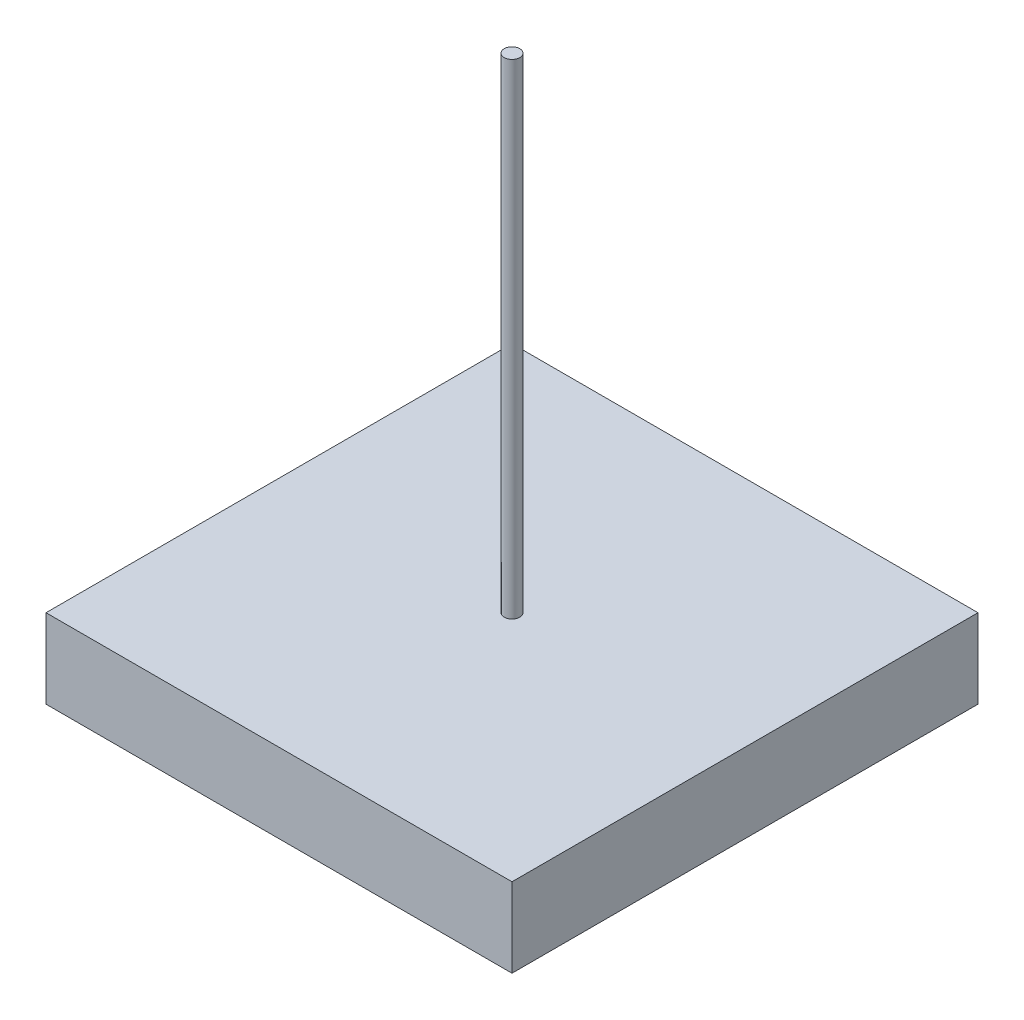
ISO-10303-21;
HEADER;
FILE_DESCRIPTION(('STEP AP214'),'2;1');
FILE_NAME('part.step','',(''),(''),'','','');
FILE_SCHEMA(('AUTOMOTIVE_DESIGN { 1 0 10303 214 1 1 1 1 }'));
ENDSEC;
DATA;
#1=APPLICATION_CONTEXT('core data for automotive mechanical design processes');
#2=APPLICATION_PROTOCOL_DEFINITION('international standard','automotive_design',2000,#1);
#3=PRODUCT_CONTEXT('',#1,'mechanical');
#4=PRODUCT('Part','Part','',(#3));
#5=PRODUCT_RELATED_PRODUCT_CATEGORY('part','',(#4));
#6=PRODUCT_DEFINITION_FORMATION('','',#4);
#7=PRODUCT_DEFINITION_CONTEXT('part definition',#1,'design');
#8=PRODUCT_DEFINITION('design','',#6,#7);
#9=PRODUCT_DEFINITION_SHAPE('','',#8);
#10=(LENGTH_UNIT() NAMED_UNIT(*) SI_UNIT(.MILLI.,.METRE.));
#11=(NAMED_UNIT(*) PLANE_ANGLE_UNIT() SI_UNIT($,.RADIAN.));
#12=(NAMED_UNIT(*) SI_UNIT($,.STERADIAN.) SOLID_ANGLE_UNIT());
#13=UNCERTAINTY_MEASURE_WITH_UNIT(LENGTH_MEASURE(1.E-05),#10,'distance_accuracy_value','');
#14=(GEOMETRIC_REPRESENTATION_CONTEXT(3) GLOBAL_UNCERTAINTY_ASSIGNED_CONTEXT((#13)) GLOBAL_UNIT_ASSIGNED_CONTEXT((#10,
#11,#12)) REPRESENTATION_CONTEXT('',''));
#15=CARTESIAN_POINT('',(0.,0.,0.));
#16=DIRECTION('',(0.,0.,1.));
#17=DIRECTION('',(1.,0.,0.));
#18=AXIS2_PLACEMENT_3D('',#15,#16,#17);
#19=CARTESIAN_POINT('',(-150.,3.,150.));
#20=DIRECTION('',(-1.,0.,0.));
#21=DIRECTION('',(0.,0.,1.));
#22=AXIS2_PLACEMENT_3D('',#19,#20,#21);
#23=PLANE('',#22);
#24=DIRECTION('',(0.,0.,-1.));
#25=VECTOR('',#24,1.);
#26=CARTESIAN_POINT('',(-150.,0.,150.));
#27=LINE('',#26,#25);
#28=CARTESIAN_POINT('',(-150.,0.,150.));
#29=VERTEX_POINT('',#28);
#30=CARTESIAN_POINT('',(-150.,0.,-150.));
#31=VERTEX_POINT('',#30);
#32=EDGE_CURVE('E107',#29,#31,#27,.T.);
#33=ORIENTED_EDGE('',*,*,#32,.F.);
#34=DIRECTION('',(0.,-1.,0.));
#35=VECTOR('',#34,1.);
#36=CARTESIAN_POINT('',(-150.,3.,150.));
#37=LINE('',#36,#35);
#38=CARTESIAN_POINT('',(-150.,51.,150.));
#39=VERTEX_POINT('',#38);
#40=EDGE_CURVE('E60',#39,#29,#37,.T.);
#41=ORIENTED_EDGE('',*,*,#40,.F.);
#42=DIRECTION('',(0.,0.,1.));
#43=VECTOR('',#42,1.);
#44=CARTESIAN_POINT('',(-150.,51.,-150.));
#45=LINE('',#44,#43);
#46=CARTESIAN_POINT('',(-150.,51.,-150.));
#47=VERTEX_POINT('',#46);
#48=EDGE_CURVE('E105',#47,#39,#45,.T.);
#49=ORIENTED_EDGE('',*,*,#48,.F.);
#50=DIRECTION('',(0.,-1.,0.));
#51=VECTOR('',#50,1.);
#52=CARTESIAN_POINT('',(-150.,3.,-150.));
#53=LINE('',#52,#51);
#54=EDGE_CURVE('E170',#47,#31,#53,.T.);
#55=ORIENTED_EDGE('',*,*,#54,.T.);
#56=EDGE_LOOP('',(#33,#41,#49,#55));
#57=FACE_BOUND('',#56,.T.);
#58=ADVANCED_FACE('F36',(#57),#23,.T.);
#59=CARTESIAN_POINT('',(-150.,3.,150.));
#60=DIRECTION('',(0.,0.,-1.));
#61=DIRECTION('',(-1.,0.,0.));
#62=AXIS2_PLACEMENT_3D('',#59,#60,#61);
#63=PLANE('',#62);
#64=DIRECTION('',(1.,0.,0.));
#65=VECTOR('',#64,1.);
#66=CARTESIAN_POINT('',(-150.,0.,150.));
#67=LINE('',#66,#65);
#68=CARTESIAN_POINT('',(150.,0.,150.));
#69=VERTEX_POINT('',#68);
#70=EDGE_CURVE('E169',#29,#69,#67,.T.);
#71=ORIENTED_EDGE('',*,*,#70,.T.);
#72=DIRECTION('',(0.,-1.,0.));
#73=VECTOR('',#72,1.);
#74=CARTESIAN_POINT('',(150.,3.,150.));
#75=LINE('',#74,#73);
#76=CARTESIAN_POINT('',(150.,51.,150.));
#77=VERTEX_POINT('',#76);
#78=EDGE_CURVE('E108',#77,#69,#75,.T.);
#79=ORIENTED_EDGE('',*,*,#78,.F.);
#80=DIRECTION('',(1.,0.,0.));
#81=VECTOR('',#80,1.);
#82=CARTESIAN_POINT('',(-150.,51.,150.));
#83=LINE('',#82,#81);
#84=EDGE_CURVE('E111',#39,#77,#83,.T.);
#85=ORIENTED_EDGE('',*,*,#84,.F.);
#86=ORIENTED_EDGE('',*,*,#40,.T.);
#87=EDGE_LOOP('',(#71,#79,#85,#86));
#88=FACE_BOUND('',#87,.T.);
#89=ADVANCED_FACE('F112',(#88),#63,.F.);
#90=CARTESIAN_POINT('',(150.,3.,150.));
#91=DIRECTION('',(-1.,0.,0.));
#92=DIRECTION('',(0.,0.,1.));
#93=AXIS2_PLACEMENT_3D('',#90,#91,#92);
#94=PLANE('',#93);
#95=DIRECTION('',(0.,0.,-1.));
#96=VECTOR('',#95,1.);
#97=CARTESIAN_POINT('',(150.,0.,150.));
#98=LINE('',#97,#96);
#99=CARTESIAN_POINT('',(150.,0.,-150.));
#100=VERTEX_POINT('',#99);
#101=EDGE_CURVE('E166',#69,#100,#98,.T.);
#102=ORIENTED_EDGE('',*,*,#101,.T.);
#103=DIRECTION('',(0.,-1.,0.));
#104=VECTOR('',#103,1.);
#105=CARTESIAN_POINT('',(150.,3.,-150.));
#106=LINE('',#105,#104);
#107=CARTESIAN_POINT('',(150.,51.,-150.));
#108=VERTEX_POINT('',#107);
#109=EDGE_CURVE('E173',#108,#100,#106,.T.);
#110=ORIENTED_EDGE('',*,*,#109,.F.);
#111=DIRECTION('',(0.,0.,-1.));
#112=VECTOR('',#111,1.);
#113=CARTESIAN_POINT('',(150.,51.,-150.));
#114=LINE('',#113,#112);
#115=EDGE_CURVE('E117',#77,#108,#114,.T.);
#116=ORIENTED_EDGE('',*,*,#115,.F.);
#117=ORIENTED_EDGE('',*,*,#78,.T.);
#118=EDGE_LOOP('',(#102,#110,#116,#117));
#119=FACE_BOUND('',#118,.T.);
#120=ADVANCED_FACE('F269',(#119),#94,.F.);
#121=CARTESIAN_POINT('',(-150.,3.,-150.));
#122=DIRECTION('',(0.,0.,-1.));
#123=DIRECTION('',(-1.,0.,0.));
#124=AXIS2_PLACEMENT_3D('',#121,#122,#123);
#125=PLANE('',#124);
#126=DIRECTION('',(1.,0.,0.));
#127=VECTOR('',#126,1.);
#128=CARTESIAN_POINT('',(-150.,0.,-150.));
#129=LINE('',#128,#127);
#130=EDGE_CURVE('E163',#31,#100,#129,.T.);
#131=ORIENTED_EDGE('',*,*,#130,.F.);
#132=ORIENTED_EDGE('',*,*,#54,.F.);
#133=DIRECTION('',(-1.,0.,0.));
#134=VECTOR('',#133,1.);
#135=CARTESIAN_POINT('',(-150.,51.,-150.));
#136=LINE('',#135,#134);
#137=EDGE_CURVE('E123',#108,#47,#136,.T.);
#138=ORIENTED_EDGE('',*,*,#137,.F.);
#139=ORIENTED_EDGE('',*,*,#109,.T.);
#140=EDGE_LOOP('',(#131,#132,#138,#139));
#141=FACE_BOUND('',#140,.T.);
#142=ADVANCED_FACE('F282',(#141),#125,.T.);
#143=CARTESIAN_POINT('',(0.,0.,0.));
#144=DIRECTION('',(0.,-1.,0.));
#145=DIRECTION('',(0.,0.,-1.));
#146=AXIS2_PLACEMENT_3D('',#143,#144,#145);
#147=PLANE('',#146);
#148=ORIENTED_EDGE('',*,*,#32,.T.);
#149=ORIENTED_EDGE('',*,*,#130,.T.);
#150=ORIENTED_EDGE('',*,*,#101,.F.);
#151=ORIENTED_EDGE('',*,*,#70,.F.);
#152=EDGE_LOOP('',(#148,#149,#150,#151));
#153=FACE_BOUND('',#152,.T.);
#154=ADVANCED_FACE('F295',(#153),#147,.T.);
#155=CARTESIAN_POINT('',(0.,51.,0.));
#156=DIRECTION('',(0.,1.,0.));
#157=DIRECTION('',(0.,0.,1.));
#158=AXIS2_PLACEMENT_3D('',#155,#156,#157);
#159=PLANE('',#158);
#160=ORIENTED_EDGE('',*,*,#48,.T.);
#161=ORIENTED_EDGE('',*,*,#84,.T.);
#162=ORIENTED_EDGE('',*,*,#115,.T.);
#163=ORIENTED_EDGE('',*,*,#137,.T.);
#164=EDGE_LOOP('',(#160,#161,#162,#163));
#165=FACE_BOUND('',#164,.T.);
#166=CARTESIAN_POINT('',(0.,51.,0.));
#167=DIRECTION('',(0.,1.,0.));
#168=DIRECTION('',(0.,0.,1.));
#169=AXIS2_PLACEMENT_3D('',#166,#167,#168);
#170=CIRCLE('',#169,5.);
#171=CARTESIAN_POINT('',(0.,51.,-5.));
#172=VERTEX_POINT('',#171);
#173=EDGE_CURVE('E39',#172,#172,#170,.T.);
#174=ORIENTED_EDGE('',*,*,#173,.F.);
#175=EDGE_LOOP('',(#174));
#176=FACE_BOUND('',#175,.T.);
#177=ADVANCED_FACE('F120',(#165,#176),#159,.T.);
#178=CARTESIAN_POINT('',(0.,363.,0.));
#179=DIRECTION('',(0.,1.,0.));
#180=DIRECTION('',(0.,0.,1.));
#181=AXIS2_PLACEMENT_3D('',#178,#179,#180);
#182=PLANE('',#181);
#183=CARTESIAN_POINT('',(0.,363.,0.));
#184=DIRECTION('',(0.,1.,0.));
#185=DIRECTION('',(0.,0.,1.));
#186=AXIS2_PLACEMENT_3D('',#183,#184,#185);
#187=CIRCLE('',#186,5.);
#188=CARTESIAN_POINT('',(0.,363.,-5.));
#189=VERTEX_POINT('',#188);
#190=EDGE_CURVE('E128',#189,#189,#187,.T.);
#191=ORIENTED_EDGE('',*,*,#190,.T.);
#192=EDGE_LOOP('',(#191));
#193=FACE_BOUND('',#192,.T.);
#194=ADVANCED_FACE('F212',(#193),#182,.T.);
#195=CARTESIAN_POINT('',(0.,363.,0.));
#196=DIRECTION('',(0.,-1.,0.));
#197=DIRECTION('',(0.,0.,-1.));
#198=AXIS2_PLACEMENT_3D('',#195,#196,#197);
#199=CYLINDRICAL_SURFACE('',#198,5.);
#200=CARTESIAN_POINT('',(0.,51.,-5.));
#201=CARTESIAN_POINT('',(0.,54.25,-5.));
#202=CARTESIAN_POINT('',(0.,57.5,-5.));
#203=CARTESIAN_POINT('',(0.,64.,-5.));
#204=CARTESIAN_POINT('',(0.,67.25,-5.));
#205=CARTESIAN_POINT('',(0.,73.75,-5.));
#206=CARTESIAN_POINT('',(0.,77.,-5.));
#207=CARTESIAN_POINT('',(0.,83.5,-5.));
#208=CARTESIAN_POINT('',(0.,86.75,-5.));
#209=CARTESIAN_POINT('',(0.,93.25,-5.));
#210=CARTESIAN_POINT('',(0.,96.5,-5.));
#211=CARTESIAN_POINT('',(0.,103.,-5.));
#212=CARTESIAN_POINT('',(0.,106.25,-5.));
#213=CARTESIAN_POINT('',(0.,112.75,-5.));
#214=CARTESIAN_POINT('',(0.,116.,-5.));
#215=CARTESIAN_POINT('',(0.,122.5,-5.));
#216=CARTESIAN_POINT('',(0.,125.75,-5.));
#217=CARTESIAN_POINT('',(0.,132.25,-5.));
#218=CARTESIAN_POINT('',(0.,135.5,-5.));
#219=CARTESIAN_POINT('',(0.,142.,-5.));
#220=CARTESIAN_POINT('',(0.,145.25,-5.));
#221=CARTESIAN_POINT('',(0.,151.75,-5.));
#222=CARTESIAN_POINT('',(0.,155.,-5.));
#223=CARTESIAN_POINT('',(0.,161.5,-5.));
#224=CARTESIAN_POINT('',(0.,164.75,-5.));
#225=CARTESIAN_POINT('',(0.,171.25,-5.));
#226=CARTESIAN_POINT('',(0.,174.5,-5.));
#227=CARTESIAN_POINT('',(0.,181.,-5.));
#228=CARTESIAN_POINT('',(0.,184.25,-5.));
#229=CARTESIAN_POINT('',(0.,190.75,-5.));
#230=CARTESIAN_POINT('',(0.,194.,-5.));
#231=CARTESIAN_POINT('',(0.,200.5,-5.));
#232=CARTESIAN_POINT('',(0.,203.75,-5.));
#233=CARTESIAN_POINT('',(0.,210.25,-5.));
#234=CARTESIAN_POINT('',(0.,213.5,-5.));
#235=CARTESIAN_POINT('',(0.,220.,-5.));
#236=CARTESIAN_POINT('',(0.,223.25,-5.));
#237=CARTESIAN_POINT('',(0.,229.75,-5.));
#238=CARTESIAN_POINT('',(0.,233.,-5.));
#239=CARTESIAN_POINT('',(0.,239.5,-5.));
#240=CARTESIAN_POINT('',(0.,242.75,-5.));
#241=CARTESIAN_POINT('',(0.,249.25,-5.));
#242=CARTESIAN_POINT('',(0.,252.5,-5.));
#243=CARTESIAN_POINT('',(0.,259.,-5.));
#244=CARTESIAN_POINT('',(0.,262.25,-5.));
#245=CARTESIAN_POINT('',(0.,268.75,-5.));
#246=CARTESIAN_POINT('',(0.,272.,-5.));
#247=CARTESIAN_POINT('',(0.,278.5,-5.));
#248=CARTESIAN_POINT('',(0.,281.75,-5.));
#249=CARTESIAN_POINT('',(0.,288.25,-5.));
#250=CARTESIAN_POINT('',(0.,291.5,-5.));
#251=CARTESIAN_POINT('',(0.,298.,-5.));
#252=CARTESIAN_POINT('',(0.,301.25,-5.));
#253=CARTESIAN_POINT('',(0.,307.75,-5.));
#254=CARTESIAN_POINT('',(0.,311.,-5.));
#255=CARTESIAN_POINT('',(0.,317.5,-5.));
#256=CARTESIAN_POINT('',(0.,320.75,-5.));
#257=CARTESIAN_POINT('',(0.,327.25,-5.));
#258=CARTESIAN_POINT('',(0.,330.5,-5.));
#259=CARTESIAN_POINT('',(0.,337.,-5.));
#260=CARTESIAN_POINT('',(0.,340.25,-5.));
#261=CARTESIAN_POINT('',(0.,346.75,-5.));
#262=CARTESIAN_POINT('',(0.,350.,-5.));
#263=CARTESIAN_POINT('',(0.,356.5,-5.));
#264=CARTESIAN_POINT('',(0.,359.75,-5.));
#265=CARTESIAN_POINT('',(0.,363.,-5.));
#266=B_SPLINE_CURVE_WITH_KNOTS('',3,(#200,#201,#202,#203,#204,#205,#206,#207,#208,#209,#210,
#211,#212,#213,#214,#215,#216,#217,#218,#219,#220,#221,#222,#223,#224,#225,#226,#227,#228,#229,
#230,#231,#232,#233,#234,#235,#236,#237,#238,#239,#240,#241,#242,#243,#244,#245,#246,#247,#248,
#249,#250,#251,#252,#253,#254,#255,#256,#257,#258,#259,#260,#261,#262,#263,#264,#265),
.UNSPECIFIED.,.F.,.F.,(4,2,2,2,2,2,2,2,2,2,2,2,2,2,2,2,2,2,2,2,2,2,2,2,2,2,2,2,2,2,2,2,4),(0.,
9.74999999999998,19.5,29.25,39.,48.75,58.5,68.25,78.,87.75,97.5,107.25,117.,126.75,136.5,146.25,
156.,165.75,175.5,185.25,195.,204.75,214.5,224.25,234.,243.75,253.5,263.25,273.,282.75,292.5,
302.25,312.),.UNSPECIFIED.);
#267=EDGE_CURVE('BSEAM193',#172,#189,#266,.T.);
#268=ORIENTED_EDGE('',*,*,#173,.T.);
#269=ORIENTED_EDGE('',*,*,#190,.F.);
#270=ORIENTED_EDGE('',*,*,#267,.T.);
#271=ORIENTED_EDGE('',*,*,#267,.F.);
#272=EDGE_LOOP('',(#268,#270,#269,#271));
#273=FACE_BOUND('',#272,.T.);
#274=ADVANCED_FACE('F193',(#273),#199,.T.);
#275=CLOSED_SHELL('',(#58,#89,#120,#142,#154,#177,#194,#274));
#276=CARTESIAN_POINT('',(0.,48.,0.));
#277=DIRECTION('',(0.,1.,0.));
#278=DIRECTION('',(0.,0.,1.));
#279=AXIS2_PLACEMENT_3D('',#276,#277,#278);
#280=PLANE('',#279);
#281=DIRECTION('',(0.,0.,1.));
#282=VECTOR('',#281,1.);
#283=CARTESIAN_POINT('',(-147.,48.,-147.));
#284=LINE('',#283,#282);
#285=CARTESIAN_POINT('',(-147.,48.,-147.));
#286=VERTEX_POINT('',#285);
#287=CARTESIAN_POINT('',(-147.,48.,147.));
#288=VERTEX_POINT('',#287);
#289=EDGE_CURVE('E132',#286,#288,#284,.T.);
#290=ORIENTED_EDGE('',*,*,#289,.F.);
#291=DIRECTION('',(-1.,0.,0.));
#292=VECTOR('',#291,1.);
#293=CARTESIAN_POINT('',(-147.,48.,-147.));
#294=LINE('',#293,#292);
#295=CARTESIAN_POINT('',(147.,48.,-147.));
#296=VERTEX_POINT('',#295);
#297=EDGE_CURVE('E142',#296,#286,#294,.T.);
#298=ORIENTED_EDGE('',*,*,#297,.F.);
#299=DIRECTION('',(0.,0.,-1.));
#300=VECTOR('',#299,1.);
#301=CARTESIAN_POINT('',(147.,48.,-147.));
#302=LINE('',#301,#300);
#303=CARTESIAN_POINT('',(147.,48.,147.));
#304=VERTEX_POINT('',#303);
#305=EDGE_CURVE('E139',#304,#296,#302,.T.);
#306=ORIENTED_EDGE('',*,*,#305,.F.);
#307=DIRECTION('',(1.,0.,0.));
#308=VECTOR('',#307,1.);
#309=CARTESIAN_POINT('',(-147.,48.,147.));
#310=LINE('',#309,#308);
#311=EDGE_CURVE('E135',#288,#304,#310,.T.);
#312=ORIENTED_EDGE('',*,*,#311,.F.);
#313=EDGE_LOOP('',(#290,#298,#306,#312));
#314=FACE_BOUND('',#313,.T.);
#315=CARTESIAN_POINT('',(0.,48.,0.));
#316=DIRECTION('',(0.,1.,0.));
#317=DIRECTION('',(0.,0.,1.));
#318=AXIS2_PLACEMENT_3D('',#315,#316,#317);
#319=CIRCLE('',#318,5.);
#320=CARTESIAN_POINT('',(0.,48.,-5.));
#321=VERTEX_POINT('',#320);
#322=EDGE_CURVE('E11',#321,#321,#319,.T.);
#323=ORIENTED_EDGE('',*,*,#322,.T.);
#324=EDGE_LOOP('',(#323));
#325=FACE_BOUND('',#324,.T.);
#326=ADVANCED_FACE('F197',(#314,#325),#280,.F.);
#327=CARTESIAN_POINT('',(-147.,48.,-147.));
#328=DIRECTION('',(0.,0.,1.));
#329=DIRECTION('',(1.,0.,0.));
#330=AXIS2_PLACEMENT_3D('',#327,#328,#329);
#331=PLANE('',#330);
#332=DIRECTION('',(-1.,0.,0.));
#333=VECTOR('',#332,1.);
#334=CARTESIAN_POINT('',(-147.,3.,-147.));
#335=LINE('',#334,#333);
#336=CARTESIAN_POINT('',(147.,3.,-147.));
#337=VERTEX_POINT('',#336);
#338=CARTESIAN_POINT('',(-147.,3.,-147.));
#339=VERTEX_POINT('',#338);
#340=EDGE_CURVE('E136',#337,#339,#335,.T.);
#341=ORIENTED_EDGE('',*,*,#340,.F.);
#342=DIRECTION('',(0.,-1.,0.));
#343=VECTOR('',#342,1.);
#344=CARTESIAN_POINT('',(147.,48.,-147.));
#345=LINE('',#344,#343);
#346=EDGE_CURVE('E155',#296,#337,#345,.T.);
#347=ORIENTED_EDGE('',*,*,#346,.F.);
#348=ORIENTED_EDGE('',*,*,#297,.T.);
#349=DIRECTION('',(0.,-1.,0.));
#350=VECTOR('',#349,1.);
#351=CARTESIAN_POINT('',(-147.,48.,-147.));
#352=LINE('',#351,#350);
#353=EDGE_CURVE('E52',#286,#339,#352,.T.);
#354=ORIENTED_EDGE('',*,*,#353,.T.);
#355=EDGE_LOOP('',(#341,#347,#348,#354));
#356=FACE_BOUND('',#355,.T.);
#357=ADVANCED_FACE('F200',(#356),#331,.T.);
#358=CARTESIAN_POINT('',(147.,48.,-147.));
#359=DIRECTION('',(-1.,0.,0.));
#360=DIRECTION('',(0.,0.,1.));
#361=AXIS2_PLACEMENT_3D('',#358,#359,#360);
#362=PLANE('',#361);
#363=DIRECTION('',(0.,0.,-1.));
#364=VECTOR('',#363,1.);
#365=CARTESIAN_POINT('',(147.,3.,-147.));
#366=LINE('',#365,#364);
#367=CARTESIAN_POINT('',(147.,3.,147.));
#368=VERTEX_POINT('',#367);
#369=EDGE_CURVE('E149',#368,#337,#366,.T.);
#370=ORIENTED_EDGE('',*,*,#369,.F.);
#371=DIRECTION('',(0.,-1.,0.));
#372=VECTOR('',#371,1.);
#373=CARTESIAN_POINT('',(147.,48.,147.));
#374=LINE('',#373,#372);
#375=EDGE_CURVE('E157',#304,#368,#374,.T.);
#376=ORIENTED_EDGE('',*,*,#375,.F.);
#377=ORIENTED_EDGE('',*,*,#305,.T.);
#378=ORIENTED_EDGE('',*,*,#346,.T.);
#379=EDGE_LOOP('',(#370,#376,#377,#378));
#380=FACE_BOUND('',#379,.T.);
#381=ADVANCED_FACE('F207',(#380),#362,.T.);
#382=CARTESIAN_POINT('',(-147.,48.,147.));
#383=DIRECTION('',(0.,0.,-1.));
#384=DIRECTION('',(-1.,0.,0.));
#385=AXIS2_PLACEMENT_3D('',#382,#383,#384);
#386=PLANE('',#385);
#387=DIRECTION('',(1.,0.,0.));
#388=VECTOR('',#387,1.);
#389=CARTESIAN_POINT('',(-147.,3.,147.));
#390=LINE('',#389,#388);
#391=CARTESIAN_POINT('',(-147.,3.,147.));
#392=VERTEX_POINT('',#391);
#393=EDGE_CURVE('E146',#392,#368,#390,.T.);
#394=ORIENTED_EDGE('',*,*,#393,.F.);
#395=DIRECTION('',(0.,-1.,0.));
#396=VECTOR('',#395,1.);
#397=CARTESIAN_POINT('',(-147.,48.,147.));
#398=LINE('',#397,#396);
#399=EDGE_CURVE('E159',#288,#392,#398,.T.);
#400=ORIENTED_EDGE('',*,*,#399,.F.);
#401=ORIENTED_EDGE('',*,*,#311,.T.);
#402=ORIENTED_EDGE('',*,*,#375,.T.);
#403=EDGE_LOOP('',(#394,#400,#401,#402));
#404=FACE_BOUND('',#403,.T.);
#405=ADVANCED_FACE('F194',(#404),#386,.T.);
#406=CARTESIAN_POINT('',(-147.,48.,-147.));
#407=DIRECTION('',(1.,0.,0.));
#408=DIRECTION('',(0.,0.,-1.));
#409=AXIS2_PLACEMENT_3D('',#406,#407,#408);
#410=PLANE('',#409);
#411=DIRECTION('',(0.,0.,1.));
#412=VECTOR('',#411,1.);
#413=CARTESIAN_POINT('',(-147.,3.,-147.));
#414=LINE('',#413,#412);
#415=EDGE_CURVE('E131',#339,#392,#414,.T.);
#416=ORIENTED_EDGE('',*,*,#415,.F.);
#417=ORIENTED_EDGE('',*,*,#353,.F.);
#418=ORIENTED_EDGE('',*,*,#289,.T.);
#419=ORIENTED_EDGE('',*,*,#399,.T.);
#420=EDGE_LOOP('',(#416,#417,#418,#419));
#421=FACE_BOUND('',#420,.T.);
#422=ADVANCED_FACE('F184',(#421),#410,.T.);
#423=CARTESIAN_POINT('',(0.,3.,0.));
#424=DIRECTION('',(0.,-1.,0.));
#425=DIRECTION('',(0.,0.,-1.));
#426=AXIS2_PLACEMENT_3D('',#423,#424,#425);
#427=PLANE('',#426);
#428=ORIENTED_EDGE('',*,*,#340,.T.);
#429=ORIENTED_EDGE('',*,*,#415,.T.);
#430=ORIENTED_EDGE('',*,*,#393,.T.);
#431=ORIENTED_EDGE('',*,*,#369,.T.);
#432=EDGE_LOOP('',(#428,#429,#430,#431));
#433=FACE_BOUND('',#432,.T.);
#434=CARTESIAN_POINT('',(0.,3.,0.));
#435=DIRECTION('',(0.,-1.,0.));
#436=DIRECTION('',(0.,0.,-1.));
#437=AXIS2_PLACEMENT_3D('',#434,#435,#436);
#438=CIRCLE('',#437,5.);
#439=CARTESIAN_POINT('',(0.,3.00000000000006,-5.));
#440=VERTEX_POINT('',#439);
#441=EDGE_CURVE('E45',#440,#440,#438,.F.);
#442=ORIENTED_EDGE('',*,*,#441,.F.);
#443=EDGE_LOOP('',(#442));
#444=FACE_BOUND('',#443,.T.);
#445=ADVANCED_FACE('F182',(#433,#444),#427,.F.);
#446=CARTESIAN_POINT('',(0.,3.00000000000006,-5.));
#447=CARTESIAN_POINT('',(0.,3.46875000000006,-5.));
#448=CARTESIAN_POINT('',(0.,3.93750000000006,-5.));
#449=CARTESIAN_POINT('',(0.,4.87500000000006,-5.));
#450=CARTESIAN_POINT('',(0.,5.34375000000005,-5.));
#451=CARTESIAN_POINT('',(0.,6.28125000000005,-5.));
#452=CARTESIAN_POINT('',(0.,6.75000000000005,-5.));
#453=CARTESIAN_POINT('',(0.,7.68750000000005,-5.));
#454=CARTESIAN_POINT('',(0.,8.15625000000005,-5.));
#455=CARTESIAN_POINT('',(0.,9.09375000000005,-5.));
#456=CARTESIAN_POINT('',(0.,9.56250000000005,-5.));
#457=CARTESIAN_POINT('',(0.,10.5,-5.));
#458=CARTESIAN_POINT('',(0.,10.96875,-5.));
#459=CARTESIAN_POINT('',(0.,11.90625,-5.));
#460=CARTESIAN_POINT('',(0.,12.375,-5.));
#461=CARTESIAN_POINT('',(0.,13.3125,-5.));
#462=CARTESIAN_POINT('',(0.,13.78125,-5.));
#463=CARTESIAN_POINT('',(0.,14.71875,-5.));
#464=CARTESIAN_POINT('',(0.,15.1875,-5.));
#465=CARTESIAN_POINT('',(0.,16.125,-5.));
#466=CARTESIAN_POINT('',(0.,16.59375,-5.));
#467=CARTESIAN_POINT('',(0.,17.53125,-5.));
#468=CARTESIAN_POINT('',(0.,18.,-5.));
#469=CARTESIAN_POINT('',(0.,18.9375,-5.));
#470=CARTESIAN_POINT('',(0.,19.40625,-5.));
#471=CARTESIAN_POINT('',(0.,20.34375,-5.));
#472=CARTESIAN_POINT('',(0.,20.8125,-5.));
#473=CARTESIAN_POINT('',(0.,21.75,-5.));
#474=CARTESIAN_POINT('',(0.,22.21875,-5.));
#475=CARTESIAN_POINT('',(0.,23.15625,-5.));
#476=CARTESIAN_POINT('',(0.,23.625,-5.));
#477=CARTESIAN_POINT('',(0.,24.5625,-5.));
#478=CARTESIAN_POINT('',(0.,25.03125,-5.));
#479=CARTESIAN_POINT('',(0.,25.96875,-5.));
#480=CARTESIAN_POINT('',(0.,26.4375,-5.));
#481=CARTESIAN_POINT('',(0.,27.375,-5.));
#482=CARTESIAN_POINT('',(0.,27.84375,-5.));
#483=CARTESIAN_POINT('',(0.,28.78125,-5.));
#484=CARTESIAN_POINT('',(0.,29.25,-5.));
#485=CARTESIAN_POINT('',(0.,30.1875,-5.));
#486=CARTESIAN_POINT('',(0.,30.65625,-5.));
#487=CARTESIAN_POINT('',(0.,31.59375,-5.));
#488=CARTESIAN_POINT('',(0.,32.0625,-5.));
#489=CARTESIAN_POINT('',(0.,33.,-5.));
#490=CARTESIAN_POINT('',(0.,33.46875,-5.));
#491=CARTESIAN_POINT('',(0.,34.40625,-5.));
#492=CARTESIAN_POINT('',(0.,34.875,-5.));
#493=CARTESIAN_POINT('',(0.,35.8125,-5.));
#494=CARTESIAN_POINT('',(0.,36.28125,-5.));
#495=CARTESIAN_POINT('',(0.,37.21875,-5.));
#496=CARTESIAN_POINT('',(0.,37.6875,-5.));
#497=CARTESIAN_POINT('',(0.,38.625,-5.));
#498=CARTESIAN_POINT('',(0.,39.09375,-5.));
#499=CARTESIAN_POINT('',(0.,40.03125,-5.));
#500=CARTESIAN_POINT('',(0.,40.5,-5.));
#501=CARTESIAN_POINT('',(0.,41.4375,-5.));
#502=CARTESIAN_POINT('',(0.,41.90625,-5.));
#503=CARTESIAN_POINT('',(0.,42.84375,-5.));
#504=CARTESIAN_POINT('',(0.,43.3125,-5.));
#505=CARTESIAN_POINT('',(0.,44.25,-5.));
#506=CARTESIAN_POINT('',(0.,44.71875,-5.));
#507=CARTESIAN_POINT('',(0.,45.65625,-5.));
#508=CARTESIAN_POINT('',(0.,46.125,-5.));
#509=CARTESIAN_POINT('',(0.,47.0625,-5.));
#510=CARTESIAN_POINT('',(0.,47.53125,-5.));
#511=CARTESIAN_POINT('',(0.,48.,-5.));
#512=B_SPLINE_CURVE_WITH_KNOTS('',3,(#446,#447,#448,#449,#450,#451,#452,#453,#454,#455,#456,
#457,#458,#459,#460,#461,#462,#463,#464,#465,#466,#467,#468,#469,#470,#471,#472,#473,#474,#475,
#476,#477,#478,#479,#480,#481,#482,#483,#484,#485,#486,#487,#488,#489,#490,#491,#492,#493,#494,
#495,#496,#497,#498,#499,#500,#501,#502,#503,#504,#505,#506,#507,#508,#509,#510,#511),
.UNSPECIFIED.,.F.,.F.,(4,2,2,2,2,2,2,2,2,2,2,2,2,2,2,2,2,2,2,2,2,2,2,2,2,2,2,2,2,2,2,2,4),(0.,
1.40625,2.8125,4.21874999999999,5.62499999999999,7.03124999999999,8.43749999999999,
9.84374999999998,11.25,12.65625,14.0625,15.46875,16.875,18.28125,19.6875,21.09375,22.5,23.90625,
25.3125,26.71875,28.125,29.53125,30.9375,32.34375,33.7499999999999,35.1562499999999,
36.5624999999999,37.9687499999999,39.3749999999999,40.7812499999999,42.1874999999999,
43.5937499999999,44.9999999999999),.UNSPECIFIED.);
#513=EDGE_CURVE('BSEAM179',#440,#321,#512,.T.);
#514=ORIENTED_EDGE('',*,*,#441,.T.);
#515=ORIENTED_EDGE('',*,*,#322,.F.);
#516=ORIENTED_EDGE('',*,*,#513,.T.);
#517=ORIENTED_EDGE('',*,*,#513,.F.);
#518=EDGE_LOOP('',(#514,#516,#515,#517));
#519=FACE_BOUND('',#518,.T.);
#520=ADVANCED_FACE('F179',(#519),#199,.T.);
#521=CLOSED_SHELL('',(#326,#357,#381,#405,#422,#445,#520));
#522=ORIENTED_CLOSED_SHELL('',*,#521,.T.);
#523=BREP_WITH_VOIDS('B2',#275,(#522));
#524=ADVANCED_BREP_SHAPE_REPRESENTATION('',(#18,#523),#14);
#525=SHAPE_DEFINITION_REPRESENTATION(#9,#524);
ENDSEC;
END-ISO-10303-21;
